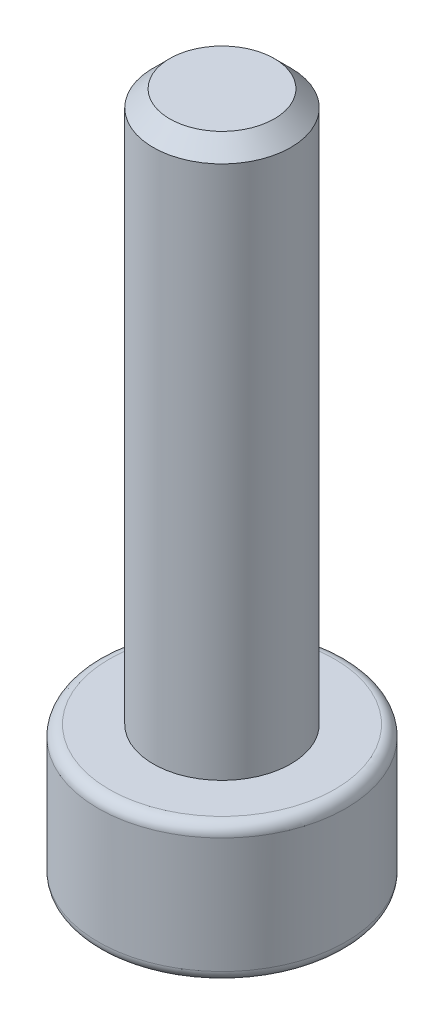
ISO-10303-21;
HEADER;
FILE_DESCRIPTION(('STEP AP214'),'2;1');
FILE_NAME('part.step','',(''),(''),'','','');
FILE_SCHEMA(('AUTOMOTIVE_DESIGN { 1 0 10303 214 1 1 1 1 }'));
ENDSEC;
DATA;
#1=APPLICATION_CONTEXT('core data for automotive mechanical design processes');
#2=APPLICATION_PROTOCOL_DEFINITION('international standard','automotive_design',2000,#1);
#3=PRODUCT_CONTEXT('',#1,'mechanical');
#4=PRODUCT('Part','Part','',(#3));
#5=PRODUCT_RELATED_PRODUCT_CATEGORY('part','',(#4));
#6=PRODUCT_DEFINITION_FORMATION('','',#4);
#7=PRODUCT_DEFINITION_CONTEXT('part definition',#1,'design');
#8=PRODUCT_DEFINITION('design','',#6,#7);
#9=PRODUCT_DEFINITION_SHAPE('','',#8);
#10=(LENGTH_UNIT() NAMED_UNIT(*) SI_UNIT(.MILLI.,.METRE.));
#11=(NAMED_UNIT(*) PLANE_ANGLE_UNIT() SI_UNIT($,.RADIAN.));
#12=(NAMED_UNIT(*) SI_UNIT($,.STERADIAN.) SOLID_ANGLE_UNIT());
#13=UNCERTAINTY_MEASURE_WITH_UNIT(LENGTH_MEASURE(1.E-05),#10,'distance_accuracy_value','');
#14=(GEOMETRIC_REPRESENTATION_CONTEXT(3) GLOBAL_UNCERTAINTY_ASSIGNED_CONTEXT((#13)) GLOBAL_UNIT_ASSIGNED_CONTEXT((#10,
#11,#12)) REPRESENTATION_CONTEXT('',''));
#15=CARTESIAN_POINT('',(0.,0.,0.));
#16=DIRECTION('',(0.,0.,1.));
#17=DIRECTION('',(1.,0.,0.));
#18=AXIS2_PLACEMENT_3D('',#15,#16,#17);
#19=CARTESIAN_POINT('',(0.,1.3,0.));
#20=DIRECTION('',(0.,-1.,0.));
#21=DIRECTION('',(0.,0.,-1.));
#22=AXIS2_PLACEMENT_3D('',#19,#20,#21);
#23=PLANE('',#22);
#24=DIRECTION('',(-0.866025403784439,0.,-0.5));
#25=VECTOR('',#24,1.);
#26=CARTESIAN_POINT('',(0.,1.3,-1.15470053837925));
#27=LINE('',#26,#25);
#28=CARTESIAN_POINT('',(0.,1.3,-1.15470053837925));
#29=VERTEX_POINT('',#28);
#30=CARTESIAN_POINT('',(1.,1.3,-0.577350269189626));
#31=VERTEX_POINT('',#30);
#32=EDGE_CURVE('E104',#29,#31,#27,.F.);
#33=ORIENTED_EDGE('',*,*,#32,.T.);
#34=DIRECTION('',(0.,0.,-1.));
#35=VECTOR('',#34,1.);
#36=CARTESIAN_POINT('',(1.,1.3,-0.577350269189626));
#37=LINE('',#36,#35);
#38=CARTESIAN_POINT('',(1.,1.3,0.577350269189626));
#39=VERTEX_POINT('',#38);
#40=EDGE_CURVE('E185',#31,#39,#37,.F.);
#41=ORIENTED_EDGE('',*,*,#40,.T.);
#42=DIRECTION('',(0.866025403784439,0.,-0.5));
#43=VECTOR('',#42,1.);
#44=CARTESIAN_POINT('',(1.,1.3,0.577350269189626));
#45=LINE('',#44,#43);
#46=CARTESIAN_POINT('',(0.,1.3,1.15470053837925));
#47=VERTEX_POINT('',#46);
#48=EDGE_CURVE('E180',#39,#47,#45,.F.);
#49=ORIENTED_EDGE('',*,*,#48,.T.);
#50=DIRECTION('',(0.866025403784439,0.,0.5));
#51=VECTOR('',#50,1.);
#52=CARTESIAN_POINT('',(0.,1.3,1.15470053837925));
#53=LINE('',#52,#51);
#54=CARTESIAN_POINT('',(-1.,1.3,0.577350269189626));
#55=VERTEX_POINT('',#54);
#56=EDGE_CURVE('E87',#47,#55,#53,.F.);
#57=ORIENTED_EDGE('',*,*,#56,.T.);
#58=DIRECTION('',(0.,0.,1.));
#59=VECTOR('',#58,1.);
#60=CARTESIAN_POINT('',(-1.,1.3,0.577350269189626));
#61=LINE('',#60,#59);
#62=CARTESIAN_POINT('',(-1.,1.3,-0.577350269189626));
#63=VERTEX_POINT('',#62);
#64=EDGE_CURVE('E84',#55,#63,#61,.F.);
#65=ORIENTED_EDGE('',*,*,#64,.T.);
#66=DIRECTION('',(-0.866025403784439,0.,0.5));
#67=VECTOR('',#66,1.);
#68=CARTESIAN_POINT('',(-1.,1.3,-0.577350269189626));
#69=LINE('',#68,#67);
#70=EDGE_CURVE('E81',#63,#29,#69,.F.);
#71=ORIENTED_EDGE('',*,*,#70,.T.);
#72=EDGE_LOOP('',(#33,#41,#49,#57,#65,#71));
#73=FACE_BOUND('',#72,.T.);
#74=ADVANCED_FACE('F17',(#73),#23,.T.);
#75=CARTESIAN_POINT('',(-1.,1.3,0.577350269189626));
#76=DIRECTION('',(-1.,0.,0.));
#77=DIRECTION('',(0.,0.,1.));
#78=AXIS2_PLACEMENT_3D('',#75,#76,#77);
#79=PLANE('',#78);
#80=DIRECTION('',(0.,1.,0.));
#81=VECTOR('',#80,1.);
#82=CARTESIAN_POINT('',(-1.,1.3,-0.577350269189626));
#83=LINE('',#82,#81);
#84=CARTESIAN_POINT('',(-1.,0.,-0.577350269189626));
#85=VERTEX_POINT('',#84);
#86=EDGE_CURVE('E90',#85,#63,#83,.T.);
#87=ORIENTED_EDGE('',*,*,#86,.T.);
#88=ORIENTED_EDGE('',*,*,#64,.F.);
#89=DIRECTION('',(0.,1.,0.));
#90=VECTOR('',#89,1.);
#91=CARTESIAN_POINT('',(-1.,1.3,0.577350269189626));
#92=LINE('',#91,#90);
#93=CARTESIAN_POINT('',(-1.,0.,0.577350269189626));
#94=VERTEX_POINT('',#93);
#95=EDGE_CURVE('E169',#55,#94,#92,.F.);
#96=ORIENTED_EDGE('',*,*,#95,.T.);
#97=DIRECTION('',(0.,0.,1.));
#98=VECTOR('',#97,1.);
#99=CARTESIAN_POINT('',(-1.,0.,0.));
#100=LINE('',#99,#98);
#101=EDGE_CURVE('E95',#94,#85,#100,.F.);
#102=ORIENTED_EDGE('',*,*,#101,.T.);
#103=EDGE_LOOP('',(#87,#88,#96,#102));
#104=FACE_BOUND('',#103,.T.);
#105=ADVANCED_FACE('F93',(#104),#79,.F.);
#106=CARTESIAN_POINT('',(-1.,1.3,-0.577350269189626));
#107=DIRECTION('',(-0.5,0.,-0.866025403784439));
#108=DIRECTION('',(-0.866025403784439,0.,0.5));
#109=AXIS2_PLACEMENT_3D('',#106,#107,#108);
#110=PLANE('',#109);
#111=DIRECTION('',(0.,1.,0.));
#112=VECTOR('',#111,1.);
#113=CARTESIAN_POINT('',(0.,1.3,-1.15470053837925));
#114=LINE('',#113,#112);
#115=CARTESIAN_POINT('',(0.,0.,-1.15470053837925));
#116=VERTEX_POINT('',#115);
#117=EDGE_CURVE('E101',#116,#29,#114,.T.);
#118=ORIENTED_EDGE('',*,*,#117,.T.);
#119=ORIENTED_EDGE('',*,*,#70,.F.);
#120=ORIENTED_EDGE('',*,*,#86,.F.);
#121=DIRECTION('',(0.866025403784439,0.,-0.5));
#122=VECTOR('',#121,1.);
#123=CARTESIAN_POINT('',(-1.,0.,-0.577350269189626));
#124=LINE('',#123,#122);
#125=EDGE_CURVE('E214',#85,#116,#124,.T.);
#126=ORIENTED_EDGE('',*,*,#125,.T.);
#127=EDGE_LOOP('',(#118,#119,#120,#126));
#128=FACE_BOUND('',#127,.T.);
#129=ADVANCED_FACE('F99',(#128),#110,.F.);
#130=CARTESIAN_POINT('',(0.,1.3,-1.15470053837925));
#131=DIRECTION('',(0.5,0.,-0.866025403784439));
#132=DIRECTION('',(-0.866025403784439,0.,-0.5));
#133=AXIS2_PLACEMENT_3D('',#130,#131,#132);
#134=PLANE('',#133);
#135=DIRECTION('',(0.,1.,0.));
#136=VECTOR('',#135,1.);
#137=CARTESIAN_POINT('',(1.,1.3,-0.577350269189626));
#138=LINE('',#137,#136);
#139=CARTESIAN_POINT('',(1.,0.,-0.577350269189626));
#140=VERTEX_POINT('',#139);
#141=EDGE_CURVE('E187',#140,#31,#138,.T.);
#142=ORIENTED_EDGE('',*,*,#141,.T.);
#143=ORIENTED_EDGE('',*,*,#32,.F.);
#144=ORIENTED_EDGE('',*,*,#117,.F.);
#145=DIRECTION('',(0.866025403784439,0.,0.5));
#146=VECTOR('',#145,1.);
#147=CARTESIAN_POINT('',(0.,0.,-1.15470053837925));
#148=LINE('',#147,#146);
#149=EDGE_CURVE('E194',#116,#140,#148,.T.);
#150=ORIENTED_EDGE('',*,*,#149,.T.);
#151=EDGE_LOOP('',(#142,#143,#144,#150));
#152=FACE_BOUND('',#151,.T.);
#153=ADVANCED_FACE('F192',(#152),#134,.F.);
#154=CARTESIAN_POINT('',(1.,1.3,-0.577350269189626));
#155=DIRECTION('',(1.,0.,0.));
#156=DIRECTION('',(0.,0.,-1.));
#157=AXIS2_PLACEMENT_3D('',#154,#155,#156);
#158=PLANE('',#157);
#159=DIRECTION('',(0.,1.,0.));
#160=VECTOR('',#159,1.);
#161=CARTESIAN_POINT('',(1.,1.3,0.577350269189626));
#162=LINE('',#161,#160);
#163=CARTESIAN_POINT('',(1.,0.,0.577350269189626));
#164=VERTEX_POINT('',#163);
#165=EDGE_CURVE('E182',#164,#39,#162,.T.);
#166=ORIENTED_EDGE('',*,*,#165,.T.);
#167=ORIENTED_EDGE('',*,*,#40,.F.);
#168=ORIENTED_EDGE('',*,*,#141,.F.);
#169=DIRECTION('',(0.,0.,1.));
#170=VECTOR('',#169,1.);
#171=CARTESIAN_POINT('',(1.,0.,0.));
#172=LINE('',#171,#170);
#173=EDGE_CURVE('E200',#140,#164,#172,.T.);
#174=ORIENTED_EDGE('',*,*,#173,.T.);
#175=EDGE_LOOP('',(#166,#167,#168,#174));
#176=FACE_BOUND('',#175,.T.);
#177=ADVANCED_FACE('F197',(#176),#158,.F.);
#178=CARTESIAN_POINT('',(1.,1.3,0.577350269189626));
#179=DIRECTION('',(0.5,0.,0.866025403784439));
#180=DIRECTION('',(0.866025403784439,0.,-0.5));
#181=AXIS2_PLACEMENT_3D('',#178,#179,#180);
#182=PLANE('',#181);
#183=DIRECTION('',(0.,1.,0.));
#184=VECTOR('',#183,1.);
#185=CARTESIAN_POINT('',(0.,1.3,1.15470053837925));
#186=LINE('',#185,#184);
#187=CARTESIAN_POINT('',(0.,0.,1.15470053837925));
#188=VERTEX_POINT('',#187);
#189=EDGE_CURVE('E177',#188,#47,#186,.T.);
#190=ORIENTED_EDGE('',*,*,#189,.T.);
#191=ORIENTED_EDGE('',*,*,#48,.F.);
#192=ORIENTED_EDGE('',*,*,#165,.F.);
#193=DIRECTION('',(-0.866025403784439,0.,0.5));
#194=VECTOR('',#193,1.);
#195=CARTESIAN_POINT('',(1.,0.,0.577350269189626));
#196=LINE('',#195,#194);
#197=EDGE_CURVE('E205',#164,#188,#196,.T.);
#198=ORIENTED_EDGE('',*,*,#197,.T.);
#199=EDGE_LOOP('',(#190,#191,#192,#198));
#200=FACE_BOUND('',#199,.T.);
#201=ADVANCED_FACE('F203',(#200),#182,.F.);
#202=CARTESIAN_POINT('',(0.,1.3,1.15470053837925));
#203=DIRECTION('',(-0.5,0.,0.866025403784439));
#204=DIRECTION('',(0.866025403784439,0.,0.5));
#205=AXIS2_PLACEMENT_3D('',#202,#203,#204);
#206=PLANE('',#205);
#207=ORIENTED_EDGE('',*,*,#95,.F.);
#208=ORIENTED_EDGE('',*,*,#56,.F.);
#209=ORIENTED_EDGE('',*,*,#189,.F.);
#210=DIRECTION('',(-0.866025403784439,0.,-0.5));
#211=VECTOR('',#210,1.);
#212=CARTESIAN_POINT('',(0.,0.,1.15470053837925));
#213=LINE('',#212,#211);
#214=EDGE_CURVE('E210',#188,#94,#213,.T.);
#215=ORIENTED_EDGE('',*,*,#214,.T.);
#216=EDGE_LOOP('',(#207,#208,#209,#215));
#217=FACE_BOUND('',#216,.T.);
#218=ADVANCED_FACE('F209',(#217),#206,.F.);
#219=CARTESIAN_POINT('',(0.,0.,0.));
#220=DIRECTION('',(0.,1.,0.));
#221=DIRECTION('',(0.,0.,1.));
#222=AXIS2_PLACEMENT_3D('',#219,#220,#221);
#223=PLANE('',#222);
#224=CARTESIAN_POINT('',(0.,0.,0.));
#225=DIRECTION('',(0.,1.,0.));
#226=DIRECTION('',(0.,0.,1.));
#227=AXIS2_PLACEMENT_3D('',#224,#225,#226);
#228=CIRCLE('',#227,2.05);
#229=CARTESIAN_POINT('',(0.,0.,2.05));
#230=VERTEX_POINT('',#229);
#231=CARTESIAN_POINT('',(0.,0.,-2.05));
#232=VERTEX_POINT('',#231);
#233=EDGE_CURVE('E212',#230,#232,#228,.T.);
#234=ORIENTED_EDGE('',*,*,#233,.F.);
#235=CARTESIAN_POINT('',(0.,0.,0.));
#236=DIRECTION('',(0.,1.,0.));
#237=DIRECTION('',(0.,0.,-1.));
#238=AXIS2_PLACEMENT_3D('',#235,#236,#237);
#239=CIRCLE('',#238,2.05);
#240=EDGE_CURVE('E231',#232,#230,#239,.T.);
#241=ORIENTED_EDGE('',*,*,#240,.F.);
#242=EDGE_LOOP('',(#234,#241));
#243=FACE_BOUND('',#242,.T.);
#244=ORIENTED_EDGE('',*,*,#197,.F.);
#245=ORIENTED_EDGE('',*,*,#173,.F.);
#246=ORIENTED_EDGE('',*,*,#149,.F.);
#247=ORIENTED_EDGE('',*,*,#125,.F.);
#248=ORIENTED_EDGE('',*,*,#101,.F.);
#249=ORIENTED_EDGE('',*,*,#214,.F.);
#250=EDGE_LOOP('',(#244,#245,#246,#247,#248,#249));
#251=FACE_BOUND('',#250,.T.);
#252=ADVANCED_FACE('F157',(#243,#251),#223,.F.);
#253=CARTESIAN_POINT('',(0.,0.2,0.));
#254=DIRECTION('',(0.,1.,0.));
#255=DIRECTION('',(0.,0.,1.));
#256=AXIS2_PLACEMENT_3D('',#253,#254,#255);
#257=TOROIDAL_SURFACE('',#256,2.05,0.2);
#258=ORIENTED_EDGE('',*,*,#233,.T.);
#259=ORIENTED_EDGE('',*,*,#240,.T.);
#260=EDGE_LOOP('',(#258,#259));
#261=FACE_BOUND('',#260,.T.);
#262=CARTESIAN_POINT('',(0.,0.2,0.));
#263=DIRECTION('',(0.,-1.,0.));
#264=DIRECTION('',(0.,0.,-1.));
#265=AXIS2_PLACEMENT_3D('',#262,#263,#264);
#266=CIRCLE('',#265,2.25);
#267=CARTESIAN_POINT('',(0.,0.2,-2.25));
#268=VERTEX_POINT('',#267);
#269=EDGE_CURVE('E148',#268,#268,#266,.F.);
#270=ORIENTED_EDGE('',*,*,#269,.F.);
#271=EDGE_LOOP('',(#270));
#272=FACE_BOUND('',#271,.T.);
#273=ADVANCED_FACE('F152',(#261,#272),#257,.T.);
#274=CARTESIAN_POINT('',(0.,2.5,0.));
#275=DIRECTION('',(0.,-1.,0.));
#276=DIRECTION('',(0.,0.,-1.));
#277=AXIS2_PLACEMENT_3D('',#274,#275,#276);
#278=CYLINDRICAL_SURFACE('',#277,2.25);
#279=CARTESIAN_POINT('',(0.,2.3,0.));
#280=DIRECTION('',(0.,1.,0.));
#281=DIRECTION('',(0.,0.,1.));
#282=AXIS2_PLACEMENT_3D('',#279,#280,#281);
#283=CIRCLE('',#282,2.25);
#284=CARTESIAN_POINT('',(0.,2.3,2.25));
#285=VERTEX_POINT('',#284);
#286=EDGE_CURVE('E112',#285,#285,#283,.T.);
#287=ORIENTED_EDGE('',*,*,#286,.F.);
#288=EDGE_LOOP('',(#287));
#289=FACE_BOUND('',#288,.T.);
#290=ORIENTED_EDGE('',*,*,#269,.T.);
#291=EDGE_LOOP('',(#290));
#292=FACE_BOUND('',#291,.T.);
#293=ADVANCED_FACE('F156',(#289,#292),#278,.T.);
#294=CARTESIAN_POINT('',(0.,12.5,0.));
#295=DIRECTION('',(0.,1.,0.));
#296=DIRECTION('',(0.,0.,1.));
#297=AXIS2_PLACEMENT_3D('',#294,#295,#296);
#298=PLANE('',#297);
#299=CARTESIAN_POINT('',(0.,12.4999999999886,0.));
#300=DIRECTION('',(0.,-1.,0.));
#301=DIRECTION('',(1.,0.,0.));
#302=AXIS2_PLACEMENT_3D('',#299,#300,#301);
#303=CIRCLE('',#302,0.949999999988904);
#304=CARTESIAN_POINT('',(0.949999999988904,12.4999999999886,0.));
#305=VERTEX_POINT('',#304);
#306=EDGE_CURVE('E108',#305,#305,#303,.T.);
#307=ORIENTED_EDGE('',*,*,#306,.F.);
#308=EDGE_LOOP('',(#307));
#309=FACE_BOUND('',#308,.T.);
#310=ADVANCED_FACE('F129',(#309),#298,.T.);
#311=CARTESIAN_POINT('',(0.,2.3,0.));
#312=DIRECTION('',(0.,1.,0.));
#313=DIRECTION('',(0.,0.,1.));
#314=AXIS2_PLACEMENT_3D('',#311,#312,#313);
#315=TOROIDAL_SURFACE('',#314,2.05,0.2);
#316=ORIENTED_EDGE('',*,*,#286,.T.);
#317=EDGE_LOOP('',(#316));
#318=FACE_BOUND('',#317,.T.);
#319=CARTESIAN_POINT('',(0.,2.5,0.));
#320=DIRECTION('',(0.,-1.,0.));
#321=DIRECTION('',(0.,0.,1.));
#322=AXIS2_PLACEMENT_3D('',#319,#320,#321);
#323=CIRCLE('',#322,2.05);
#324=CARTESIAN_POINT('',(0.,2.5,-2.05));
#325=VERTEX_POINT('',#324);
#326=CARTESIAN_POINT('',(0.,2.5,2.05));
#327=VERTEX_POINT('',#326);
#328=EDGE_CURVE('E36',#325,#327,#323,.F.);
#329=ORIENTED_EDGE('',*,*,#328,.F.);
#330=CARTESIAN_POINT('',(0.,2.5,0.));
#331=DIRECTION('',(0.,-1.,0.));
#332=DIRECTION('',(0.,0.,-1.));
#333=AXIS2_PLACEMENT_3D('',#330,#331,#332);
#334=CIRCLE('',#333,2.05);
#335=EDGE_CURVE('E111',#327,#325,#334,.F.);
#336=ORIENTED_EDGE('',*,*,#335,.F.);
#337=EDGE_LOOP('',(#329,#336));
#338=FACE_BOUND('',#337,.T.);
#339=ADVANCED_FACE('F117',(#318,#338),#315,.T.);
#340=CARTESIAN_POINT('',(0.,12.2000000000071,0.));
#341=DIRECTION('',(0.,-1.,0.));
#342=DIRECTION('',(1.,0.,0.));
#343=AXIS2_PLACEMENT_3D('',#340,#341,#342);
#344=CONICAL_SURFACE('',#343,1.2499999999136,0.785398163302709);
#345=CARTESIAN_POINT('',(0.,12.2,0.));
#346=DIRECTION('',(0.,-1.,0.));
#347=DIRECTION('',(0.,0.,-1.));
#348=AXIS2_PLACEMENT_3D('',#345,#346,#347);
#349=CIRCLE('',#348,1.25);
#350=CARTESIAN_POINT('',(0.,12.2,-1.25));
#351=VERTEX_POINT('',#350);
#352=EDGE_CURVE('E28',#351,#351,#349,.T.);
#353=ORIENTED_EDGE('',*,*,#352,.F.);
#354=EDGE_LOOP('',(#353));
#355=FACE_BOUND('',#354,.T.);
#356=ORIENTED_EDGE('',*,*,#306,.T.);
#357=EDGE_LOOP('',(#356));
#358=FACE_BOUND('',#357,.T.);
#359=ADVANCED_FACE('F128',(#355,#358),#344,.T.);
#360=CARTESIAN_POINT('',(0.,2.5,0.));
#361=DIRECTION('',(0.,1.,0.));
#362=DIRECTION('',(0.,0.,1.));
#363=AXIS2_PLACEMENT_3D('',#360,#361,#362);
#364=PLANE('',#363);
#365=CARTESIAN_POINT('',(0.,2.5,0.));
#366=DIRECTION('',(0.,-1.,0.));
#367=DIRECTION('',(0.,0.,-1.));
#368=AXIS2_PLACEMENT_3D('',#365,#366,#367);
#369=CIRCLE('',#368,1.25);
#370=CARTESIAN_POINT('',(0.,2.5,-1.25));
#371=VERTEX_POINT('',#370);
#372=EDGE_CURVE('E11',#371,#371,#369,.F.);
#373=ORIENTED_EDGE('',*,*,#372,.F.);
#374=EDGE_LOOP('',(#373));
#375=FACE_BOUND('',#374,.T.);
#376=ORIENTED_EDGE('',*,*,#335,.T.);
#377=ORIENTED_EDGE('',*,*,#328,.T.);
#378=EDGE_LOOP('',(#376,#377));
#379=FACE_BOUND('',#378,.T.);
#380=ADVANCED_FACE('F253',(#375,#379),#364,.T.);
#381=CARTESIAN_POINT('',(0.,12.5,0.));
#382=DIRECTION('',(0.,-1.,0.));
#383=DIRECTION('',(0.,0.,-1.));
#384=AXIS2_PLACEMENT_3D('',#381,#382,#383);
#385=CYLINDRICAL_SURFACE('',#384,1.25);
#386=ORIENTED_EDGE('',*,*,#372,.T.);
#387=EDGE_LOOP('',(#386));
#388=FACE_BOUND('',#387,.T.);
#389=ORIENTED_EDGE('',*,*,#352,.T.);
#390=EDGE_LOOP('',(#389));
#391=FACE_BOUND('',#390,.T.);
#392=ADVANCED_FACE('F251',(#388,#391),#385,.T.);
#393=CLOSED_SHELL('',(#74,#105,#129,#153,#177,#201,#218,#252,#273,#293,#310,#339,#359,#380,#392));
#394=MANIFOLD_SOLID_BREP('B1',#393);
#395=ADVANCED_BREP_SHAPE_REPRESENTATION('',(#18,#394),#14);
#396=SHAPE_DEFINITION_REPRESENTATION(#9,#395);
ENDSEC;
END-ISO-10303-21;
